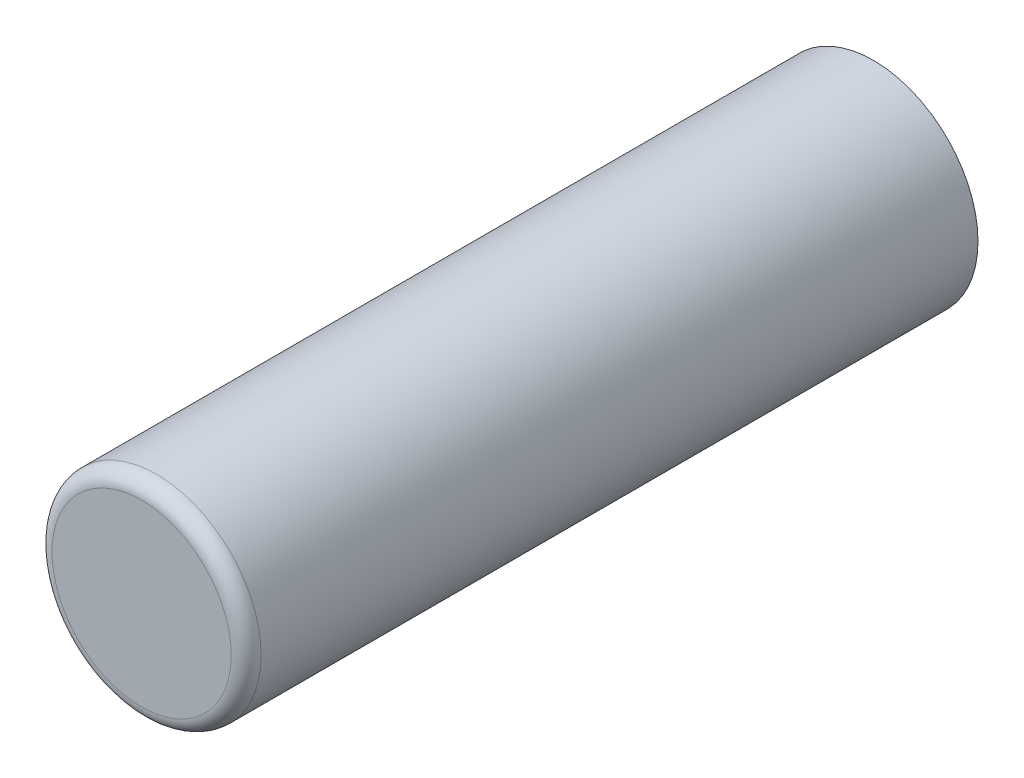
ISO-10303-21;
HEADER;
FILE_DESCRIPTION(('STEP AP214'),'2;1');
FILE_NAME('part.step','',(''),(''),'','','');
FILE_SCHEMA(('AUTOMOTIVE_DESIGN { 1 0 10303 214 1 1 1 1 }'));
ENDSEC;
DATA;
#1=APPLICATION_CONTEXT('core data for automotive mechanical design processes');
#2=APPLICATION_PROTOCOL_DEFINITION('international standard','automotive_design',2000,#1);
#3=PRODUCT_CONTEXT('',#1,'mechanical');
#4=PRODUCT('Part','Part','',(#3));
#5=PRODUCT_RELATED_PRODUCT_CATEGORY('part','',(#4));
#6=PRODUCT_DEFINITION_FORMATION('','',#4);
#7=PRODUCT_DEFINITION_CONTEXT('part definition',#1,'design');
#8=PRODUCT_DEFINITION('design','',#6,#7);
#9=PRODUCT_DEFINITION_SHAPE('','',#8);
#10=(LENGTH_UNIT() NAMED_UNIT(*) SI_UNIT(.MILLI.,.METRE.));
#11=(NAMED_UNIT(*) PLANE_ANGLE_UNIT() SI_UNIT($,.RADIAN.));
#12=(NAMED_UNIT(*) SI_UNIT($,.STERADIAN.) SOLID_ANGLE_UNIT());
#13=UNCERTAINTY_MEASURE_WITH_UNIT(LENGTH_MEASURE(1.E-05),#10,'distance_accuracy_value','');
#14=(GEOMETRIC_REPRESENTATION_CONTEXT(3) GLOBAL_UNCERTAINTY_ASSIGNED_CONTEXT((#13)) GLOBAL_UNIT_ASSIGNED_CONTEXT((#10,
#11,#12)) REPRESENTATION_CONTEXT('',''));
#15=CARTESIAN_POINT('',(0.,0.,0.));
#16=DIRECTION('',(0.,0.,1.));
#17=DIRECTION('',(1.,0.,0.));
#18=AXIS2_PLACEMENT_3D('',#15,#16,#17);
#19=CARTESIAN_POINT('',(0.,0.,24.5));
#20=DIRECTION('',(0.,0.,-1.));
#21=DIRECTION('',(-1.,0.,0.));
#22=AXIS2_PLACEMENT_3D('',#19,#20,#21);
#23=CYLINDRICAL_SURFACE('',#22,3.5);
#24=CARTESIAN_POINT('',(0.,0.,24.));
#25=DIRECTION('',(0.,0.,1.));
#26=DIRECTION('',(1.,0.,0.));
#27=AXIS2_PLACEMENT_3D('',#24,#25,#26);
#28=CIRCLE('',#27,3.5);
#29=CARTESIAN_POINT('',(3.5,0.,24.));
#30=VERTEX_POINT('',#29);
#31=EDGE_CURVE('E10',#30,#30,#28,.F.);
#32=ORIENTED_EDGE('',*,*,#31,.T.);
#33=EDGE_LOOP('',(#32));
#34=FACE_BOUND('',#33,.T.);
#35=CARTESIAN_POINT('',(0.,0.,0.));
#36=DIRECTION('',(0.,0.,1.));
#37=DIRECTION('',(1.,0.,0.));
#38=AXIS2_PLACEMENT_3D('',#35,#36,#37);
#39=CIRCLE('',#38,3.5);
#40=CARTESIAN_POINT('',(3.5,0.,0.));
#41=VERTEX_POINT('',#40);
#42=EDGE_CURVE('E54',#41,#41,#39,.T.);
#43=ORIENTED_EDGE('',*,*,#42,.T.);
#44=EDGE_LOOP('',(#43));
#45=FACE_BOUND('',#44,.T.);
#46=ADVANCED_FACE('F41',(#34,#45),#23,.T.);
#47=CARTESIAN_POINT('',(0.,0.,24.5));
#48=DIRECTION('',(0.,0.,1.));
#49=DIRECTION('',(1.,0.,0.));
#50=AXIS2_PLACEMENT_3D('',#47,#48,#49);
#51=PLANE('',#50);
#52=CARTESIAN_POINT('',(0.,0.,24.5));
#53=DIRECTION('',(0.,0.,1.));
#54=DIRECTION('',(1.,0.,0.));
#55=AXIS2_PLACEMENT_3D('',#52,#53,#54);
#56=CIRCLE('',#55,3.);
#57=CARTESIAN_POINT('',(3.,0.,24.5));
#58=VERTEX_POINT('',#57);
#59=EDGE_CURVE('E49',#58,#58,#56,.T.);
#60=ORIENTED_EDGE('',*,*,#59,.T.);
#61=EDGE_LOOP('',(#60));
#62=FACE_BOUND('',#61,.T.);
#63=ADVANCED_FACE('F65',(#62),#51,.T.);
#64=CARTESIAN_POINT('',(0.,0.,0.));
#65=DIRECTION('',(0.,0.,1.));
#66=DIRECTION('',(1.,0.,0.));
#67=AXIS2_PLACEMENT_3D('',#64,#65,#66);
#68=PLANE('',#67);
#69=ORIENTED_EDGE('',*,*,#42,.F.);
#70=EDGE_LOOP('',(#69));
#71=FACE_BOUND('',#70,.T.);
#72=ADVANCED_FACE('F63',(#71),#68,.F.);
#73=CARTESIAN_POINT('',(0.,0.,24.));
#74=DIRECTION('',(0.,0.,1.));
#75=DIRECTION('',(1.,0.,0.));
#76=AXIS2_PLACEMENT_3D('',#73,#74,#75);
#77=TOROIDAL_SURFACE('',#76,3.,0.5);
#78=ORIENTED_EDGE('',*,*,#31,.F.);
#79=EDGE_LOOP('',(#78));
#80=FACE_BOUND('',#79,.T.);
#81=ORIENTED_EDGE('',*,*,#59,.F.);
#82=EDGE_LOOP('',(#81));
#83=FACE_BOUND('',#82,.T.);
#84=ADVANCED_FACE('F43',(#80,#83),#77,.T.);
#85=CLOSED_SHELL('',(#46,#63,#72,#84));
#86=MANIFOLD_SOLID_BREP('B2',#85);
#87=ADVANCED_BREP_SHAPE_REPRESENTATION('',(#18,#86),#14);
#88=SHAPE_DEFINITION_REPRESENTATION(#9,#87);
ENDSEC;
END-ISO-10303-21;
